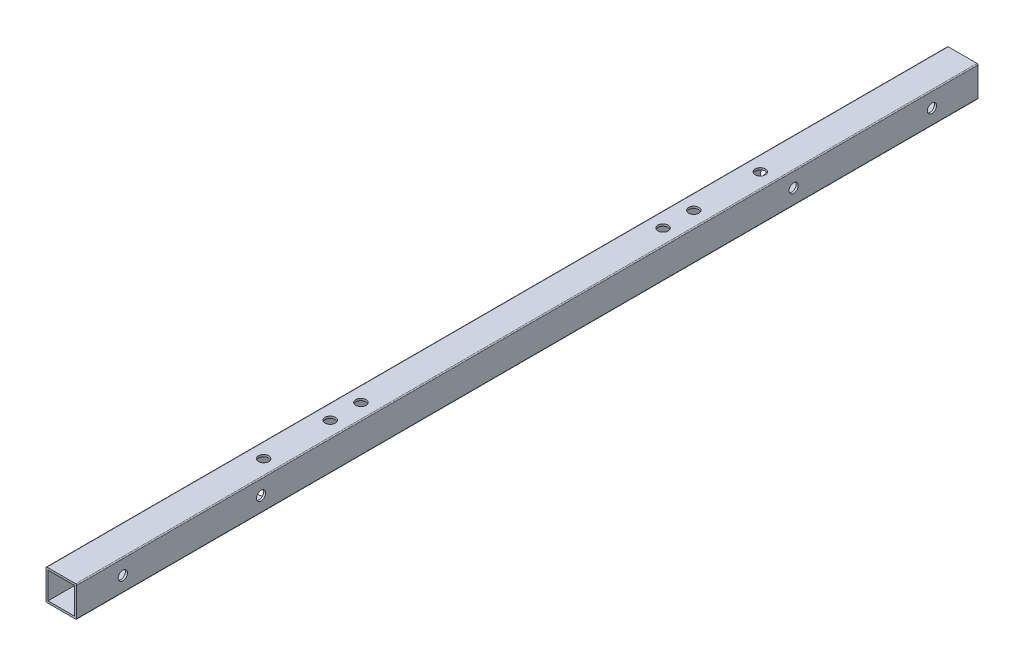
from build123d import *

# Parameters (mm, degrees)
ESQUISSE1_W             = 26
ESQUISSE1_H             = 26
BASE_EXTRU_MINCE_DEPTH  = 880
ESQUISSE2_R             = 5
ENL_V_MAT_EXTRU_1_DEPTH = 35
ESQUISSE3_R             = 4.5
ENL_V_MAT_EXTRU_2_DEPTH = 881.638972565


with BuildPart() as part:
    # Esquisse1 → Base-Extru.-Mince (new body)
    with BuildSketch(Plane.XY):
        with BuildLine():
            Line((14, -15), (-14, -15))
            ThreePointArc((-14, -15), (-14.707106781, -14.707106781), (-15, -14))
            Line((-15, -14), (-15, 14))
            ThreePointArc((-15, 14), (-14.707106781, 14.707106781), (-14, 15))
            Line((-14, 15), (14, 15))
            ThreePointArc((14, 15), (14.707106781, 14.707106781), (15, 14))
            Line((15, 14), (15, -14))
            ThreePointArc((15, -14), (14.707106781, -14.707106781), (14, -15))
        make_face()
        Rectangle(ESQUISSE1_W, ESQUISSE1_H, mode=Mode.SUBTRACT)
    extrude(amount=BASE_EXTRU_MINCE_DEPTH)

    # Esquisse2 → Enl_v. mat.-Extru.1 (cut)
    with BuildSketch(Plane(origin=(0, 15, 0), x_dir=(-1, 0, 0), z_dir=(0, 1, 0))):
        with Locations(Location((0, 292.5, 0), (0, 0, 90))):
            Circle(ESQUISSE2_R)
        with Locations(Location((0, 587.5, 0), (0, 0, 180))):
            Circle(ESQUISSE2_R)
        with Locations(Location((0, 197.5, 0), (0, 0, 90))):
            Circle(ESQUISSE2_R)
        with Locations(Location((0, 262.5, 0), (0, 0, 90))):
            Circle(ESQUISSE2_R)
        with Locations(Location((0, 617.5, 0), (0, 0, 90))):
            Circle(ESQUISSE2_R)
        with Locations(Location((0, 682.5, 0), (0, 0, 90))):
            Circle(ESQUISSE2_R)
    extrude(amount=-ENL_V_MAT_EXTRU_1_DEPTH, mode=Mode.SUBTRACT)

    # Esquisse3 → Enl_v. mat.-Extru.2 (cut, through all)
    with BuildSketch(Plane(origin=(15, 0, 0), x_dir=(0, 0, -1), z_dir=(1, 0, 0))):
        with Locations(Location((-835, 0, 0), (0, 0, 90))):
            Circle(ESQUISSE3_R)
        with Locations(Location((-700, 0, 0), (0, 0, 90))):
            Circle(ESQUISSE3_R)
        with Locations(Location((-180, 0, 0), (0, 0, 90))):
            Circle(ESQUISSE3_R)
        with Locations(Location((-45, 0, 0), (0, 0, 90))):
            Circle(ESQUISSE3_R)
    extrude(amount=-ENL_V_MAT_EXTRU_2_DEPTH, mode=Mode.SUBTRACT)


solid = part.part
